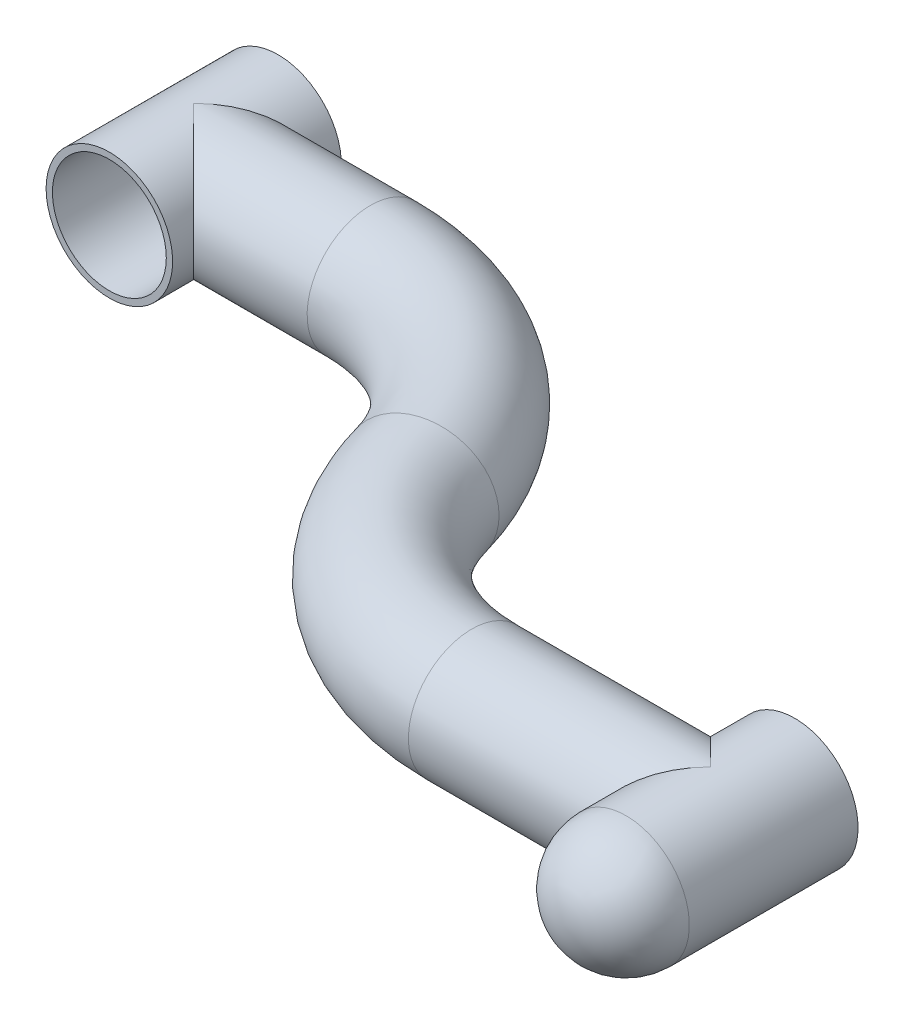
from build123d import *

# Parameters (mm, degrees)
ESQUISSE2_R             = 30
ESQUISSE2_R_2           = 27
ESQUISSE3_W             = 30
ESQUISSE3_H             = 80
ESQUISSE4_W             = 30
ESQUISSE4_H             = 80
ESQUISSE5_R             = 27
ENL_V_MAT_EXTRU_1_DEPTH = 485.174555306


with BuildPart() as part:
    # Balayage1: sweep along a path in Esquisse1
    with BuildLine(Plane(origin=(0, 0, 0), x_dir=(1, 0, 0), z_dir=(0, 1, 0))) as balayage1_path:
        Line((0, 0), (-113.203482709, 0))
        ThreePointArc((-113.203482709, 0), (-175.308220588, 20.866700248), (-212.213552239, 75))
        ThreePointArc((-212.213552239, 75), (-249.11888389, 129.133299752), (-311.223621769, 150))
        Line((-311.223621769, 150), (-395, 150))
    # Esquisse2 → Balayage1 (sweep)
    with BuildSketch(Plane(origin=(0, 0, 0), x_dir=(0, 0, -1), z_dir=(1, 0, 0))):
        Circle(ESQUISSE2_R)
        Circle(ESQUISSE2_R_2, mode=Mode.SUBTRACT)
    sweep(path=balayage1_path.line)

    # Esquisse3 → R_volution1 (revolve)
    with BuildSketch(Plane(origin=(0, 0, 0), x_dir=(1, 0, 0), z_dir=(0, 1, 0)), mode=Mode.PRIVATE) as r_volution1_sk:
        with Locations((15, 0)):
            Rectangle(ESQUISSE3_W, ESQUISSE3_H)
    revolve(r_volution1_sk.sketch.rotate(Axis((0, 0, -40), (0, 0, 1)), 180), axis=Axis((0, 0, -40), (0, 0, 1)))

    # Esquisse4 → R_volution2 (revolve)
    with BuildSketch(Plane(origin=(0, 0, 0), x_dir=(1, 0, 0), z_dir=(0, 1, 0))):
        with Locations((-410, 150)):
            Rectangle(ESQUISSE4_W, ESQUISSE4_H)
    revolve(axis=Axis((-395, 0, -190), (0, 0, 1)))

    # Esquisse5 → Enl_v. mat.-Extru.1 (cut, through all)
    with BuildSketch(Plane.XY.offset(40)):
        Circle(ESQUISSE5_R)
        with Locations((-395, 0)):
            Circle(ESQUISSE5_R)
    extrude(amount=-ENL_V_MAT_EXTRU_1_DEPTH, mode=Mode.SUBTRACT)

    # Esquisse6 → R_volution3 (revolve)
    with BuildSketch(Plane(origin=(0, 0, 0), x_dir=(1, 0, 0), z_dir=(0, 1, 0))):
        with BuildLine():
            Line((-30, -40), (0, -40))
            Line((0, -40), (0, -70))
            ThreePointArc((0, -70), (-21.213203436, -61.213203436), (-30, -40))
        make_face()
    revolve(axis=Axis((0, 0, 40), (0, 0, 1)))


solid = part.part
